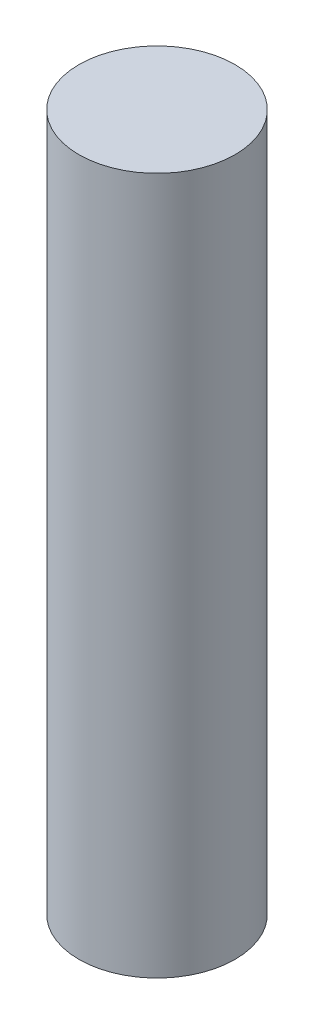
ISO-10303-21;
HEADER;
FILE_DESCRIPTION(('STEP AP214'),'2;1');
FILE_NAME('part.step','',(''),(''),'','','');
FILE_SCHEMA(('AUTOMOTIVE_DESIGN { 1 0 10303 214 1 1 1 1 }'));
ENDSEC;
DATA;
#1=APPLICATION_CONTEXT('core data for automotive mechanical design processes');
#2=APPLICATION_PROTOCOL_DEFINITION('international standard','automotive_design',2000,#1);
#3=PRODUCT_CONTEXT('',#1,'mechanical');
#4=PRODUCT('Part','Part','',(#3));
#5=PRODUCT_RELATED_PRODUCT_CATEGORY('part','',(#4));
#6=PRODUCT_DEFINITION_FORMATION('','',#4);
#7=PRODUCT_DEFINITION_CONTEXT('part definition',#1,'design');
#8=PRODUCT_DEFINITION('design','',#6,#7);
#9=PRODUCT_DEFINITION_SHAPE('','',#8);
#10=(LENGTH_UNIT() NAMED_UNIT(*) SI_UNIT(.MILLI.,.METRE.));
#11=(NAMED_UNIT(*) PLANE_ANGLE_UNIT() SI_UNIT($,.RADIAN.));
#12=(NAMED_UNIT(*) SI_UNIT($,.STERADIAN.) SOLID_ANGLE_UNIT());
#13=UNCERTAINTY_MEASURE_WITH_UNIT(LENGTH_MEASURE(1.E-05),#10,'distance_accuracy_value','');
#14=(GEOMETRIC_REPRESENTATION_CONTEXT(3) GLOBAL_UNCERTAINTY_ASSIGNED_CONTEXT((#13)) GLOBAL_UNIT_ASSIGNED_CONTEXT((#10,
#11,#12)) REPRESENTATION_CONTEXT('',''));
#15=CARTESIAN_POINT('',(0.,0.,0.));
#16=DIRECTION('',(0.,0.,1.));
#17=DIRECTION('',(1.,0.,0.));
#18=AXIS2_PLACEMENT_3D('',#15,#16,#17);
#19=CARTESIAN_POINT('',(0.,12.7,0.));
#20=DIRECTION('',(0.,-1.,0.));
#21=DIRECTION('',(0.,0.,-1.));
#22=AXIS2_PLACEMENT_3D('',#19,#20,#21);
#23=CYLINDRICAL_SURFACE('',#22,1.4224);
#24=CARTESIAN_POINT('',(0.,12.7,0.));
#25=DIRECTION('',(0.,1.,0.));
#26=DIRECTION('',(0.,0.,1.));
#27=AXIS2_PLACEMENT_3D('',#24,#25,#26);
#28=CIRCLE('',#27,1.4224);
#29=CARTESIAN_POINT('',(0.,12.7,1.4224));
#30=VERTEX_POINT('',#29);
#31=EDGE_CURVE('E10',#30,#30,#28,.T.);
#32=ORIENTED_EDGE('',*,*,#31,.F.);
#33=EDGE_LOOP('',(#32));
#34=FACE_BOUND('',#33,.T.);
#35=CARTESIAN_POINT('',(0.,0.,0.));
#36=DIRECTION('',(0.,1.,0.));
#37=DIRECTION('',(0.,0.,1.));
#38=AXIS2_PLACEMENT_3D('',#35,#36,#37);
#39=CIRCLE('',#38,1.4224);
#40=CARTESIAN_POINT('',(0.,0.,1.4224));
#41=VERTEX_POINT('',#40);
#42=EDGE_CURVE('E33',#41,#41,#39,.T.);
#43=ORIENTED_EDGE('',*,*,#42,.T.);
#44=EDGE_LOOP('',(#43));
#45=FACE_BOUND('',#44,.T.);
#46=ADVANCED_FACE('F30',(#34,#45),#23,.T.);
#47=CARTESIAN_POINT('',(0.,12.7,0.));
#48=DIRECTION('',(0.,1.,0.));
#49=DIRECTION('',(0.,0.,1.));
#50=AXIS2_PLACEMENT_3D('',#47,#48,#49);
#51=PLANE('',#50);
#52=ORIENTED_EDGE('',*,*,#31,.T.);
#53=EDGE_LOOP('',(#52));
#54=FACE_BOUND('',#53,.T.);
#55=ADVANCED_FACE('F45',(#54),#51,.T.);
#56=CARTESIAN_POINT('',(0.,0.,0.));
#57=DIRECTION('',(0.,1.,0.));
#58=DIRECTION('',(0.,0.,1.));
#59=AXIS2_PLACEMENT_3D('',#56,#57,#58);
#60=PLANE('',#59);
#61=ORIENTED_EDGE('',*,*,#42,.F.);
#62=EDGE_LOOP('',(#61));
#63=FACE_BOUND('',#62,.T.);
#64=ADVANCED_FACE('F43',(#63),#60,.F.);
#65=CLOSED_SHELL('',(#46,#55,#64));
#66=MANIFOLD_SOLID_BREP('B2',#65);
#67=ADVANCED_BREP_SHAPE_REPRESENTATION('',(#18,#66),#14);
#68=SHAPE_DEFINITION_REPRESENTATION(#9,#67);
ENDSEC;
END-ISO-10303-21;
